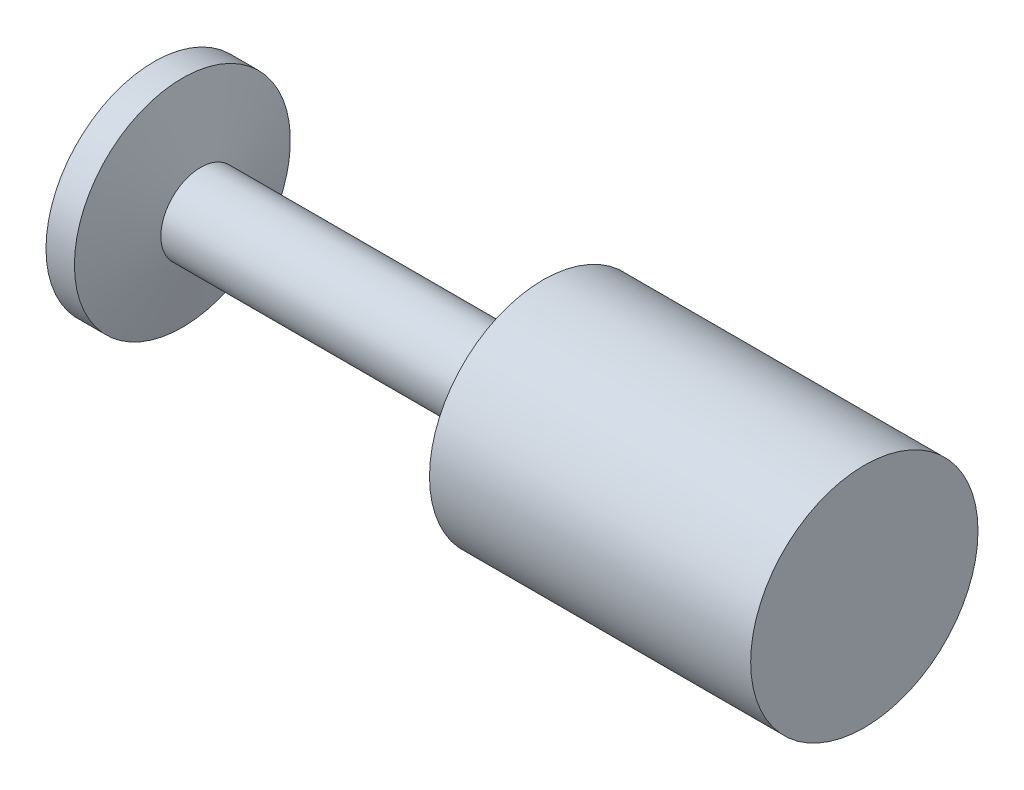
ISO-10303-21;
HEADER;
FILE_DESCRIPTION(('STEP AP214'),'2;1');
FILE_NAME('part.step','',(''),(''),'','','');
FILE_SCHEMA(('AUTOMOTIVE_DESIGN { 1 0 10303 214 1 1 1 1 }'));
ENDSEC;
DATA;
#1=APPLICATION_CONTEXT('core data for automotive mechanical design processes');
#2=APPLICATION_PROTOCOL_DEFINITION('international standard','automotive_design',2000,#1);
#3=PRODUCT_CONTEXT('',#1,'mechanical');
#4=PRODUCT('Part','Part','',(#3));
#5=PRODUCT_RELATED_PRODUCT_CATEGORY('part','',(#4));
#6=PRODUCT_DEFINITION_FORMATION('','',#4);
#7=PRODUCT_DEFINITION_CONTEXT('part definition',#1,'design');
#8=PRODUCT_DEFINITION('design','',#6,#7);
#9=PRODUCT_DEFINITION_SHAPE('','',#8);
#10=(LENGTH_UNIT() NAMED_UNIT(*) SI_UNIT(.MILLI.,.METRE.));
#11=(NAMED_UNIT(*) PLANE_ANGLE_UNIT() SI_UNIT($,.RADIAN.));
#12=(NAMED_UNIT(*) SI_UNIT($,.STERADIAN.) SOLID_ANGLE_UNIT());
#13=UNCERTAINTY_MEASURE_WITH_UNIT(LENGTH_MEASURE(1.E-05),#10,'distance_accuracy_value','');
#14=(GEOMETRIC_REPRESENTATION_CONTEXT(3) GLOBAL_UNCERTAINTY_ASSIGNED_CONTEXT((#13)) GLOBAL_UNIT_ASSIGNED_CONTEXT((#10,
#11,#12)) REPRESENTATION_CONTEXT('',''));
#15=CARTESIAN_POINT('',(0.,0.,0.));
#16=DIRECTION('',(0.,0.,1.));
#17=DIRECTION('',(1.,0.,0.));
#18=AXIS2_PLACEMENT_3D('',#15,#16,#17);
#19=CARTESIAN_POINT('',(0.,0.,0.));
#20=DIRECTION('',(1.,0.,0.));
#21=DIRECTION('',(0.,0.,-1.));
#22=AXIS2_PLACEMENT_3D('',#19,#20,#21);
#23=PLANE('',#22);
#24=CARTESIAN_POINT('',(0.,0.,0.));
#25=DIRECTION('',(-1.,0.,0.));
#26=DIRECTION('',(0.,0.,1.));
#27=AXIS2_PLACEMENT_3D('',#24,#25,#26);
#28=CIRCLE('',#27,19.);
#29=CARTESIAN_POINT('',(0.,0.,19.));
#30=VERTEX_POINT('',#29);
#31=EDGE_CURVE('E10',#30,#30,#28,.T.);
#32=ORIENTED_EDGE('',*,*,#31,.T.);
#33=EDGE_LOOP('',(#32));
#34=FACE_BOUND('',#33,.T.);
#35=ADVANCED_FACE('F30',(#34),#23,.F.);
#36=CARTESIAN_POINT('',(-18.0553016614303,0.,0.));
#37=DIRECTION('',(-1.,0.,0.));
#38=DIRECTION('',(0.,0.,1.));
#39=AXIS2_PLACEMENT_3D('',#36,#37,#38);
#40=CYLINDRICAL_SURFACE('',#39,19.);
#41=ORIENTED_EDGE('',*,*,#31,.F.);
#42=EDGE_LOOP('',(#41));
#43=FACE_BOUND('',#42,.T.);
#44=CARTESIAN_POINT('',(5.,0.,0.));
#45=DIRECTION('',(-1.,0.,0.));
#46=DIRECTION('',(0.,0.,1.));
#47=AXIS2_PLACEMENT_3D('',#44,#45,#46);
#48=CIRCLE('',#47,19.);
#49=CARTESIAN_POINT('',(5.,0.,19.));
#50=VERTEX_POINT('',#49);
#51=EDGE_CURVE('E36',#50,#50,#48,.T.);
#52=ORIENTED_EDGE('',*,*,#51,.T.);
#53=EDGE_LOOP('',(#52));
#54=FACE_BOUND('',#53,.T.);
#55=ADVANCED_FACE('F68',(#43,#54),#40,.T.);
#56=CARTESIAN_POINT('',(8.21539030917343,0.,0.));
#57=DIRECTION('',(-1.,0.,0.));
#58=DIRECTION('',(0.,0.,1.));
#59=AXIS2_PLACEMENT_3D('',#56,#57,#58);
#60=CONICAL_SURFACE('',#59,7.,1.30899693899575);
#61=ORIENTED_EDGE('',*,*,#51,.F.);
#62=EDGE_LOOP('',(#61));
#63=FACE_BOUND('',#62,.T.);
#64=CARTESIAN_POINT('',(8.21539030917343,0.,0.));
#65=DIRECTION('',(-1.,0.,0.));
#66=DIRECTION('',(0.,0.,1.));
#67=AXIS2_PLACEMENT_3D('',#64,#65,#66);
#68=CIRCLE('',#67,7.);
#69=CARTESIAN_POINT('',(8.21539030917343,0.,7.));
#70=VERTEX_POINT('',#69);
#71=EDGE_CURVE('E40',#70,#70,#68,.T.);
#72=ORIENTED_EDGE('',*,*,#71,.T.);
#73=EDGE_LOOP('',(#72));
#74=FACE_BOUND('',#73,.T.);
#75=ADVANCED_FACE('F72',(#63,#74),#60,.T.);
#76=CARTESIAN_POINT('',(-18.0553016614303,0.,0.));
#77=DIRECTION('',(-1.,0.,0.));
#78=DIRECTION('',(0.,0.,1.));
#79=AXIS2_PLACEMENT_3D('',#76,#77,#78);
#80=CYLINDRICAL_SURFACE('',#79,7.);
#81=ORIENTED_EDGE('',*,*,#71,.F.);
#82=EDGE_LOOP('',(#81));
#83=FACE_BOUND('',#82,.T.);
#84=CARTESIAN_POINT('',(65.,0.,0.));
#85=DIRECTION('',(-1.,0.,0.));
#86=DIRECTION('',(0.,0.,1.));
#87=AXIS2_PLACEMENT_3D('',#84,#85,#86);
#88=CIRCLE('',#87,7.);
#89=CARTESIAN_POINT('',(65.,0.,7.));
#90=VERTEX_POINT('',#89);
#91=EDGE_CURVE('E44',#90,#90,#88,.T.);
#92=ORIENTED_EDGE('',*,*,#91,.T.);
#93=EDGE_LOOP('',(#92));
#94=FACE_BOUND('',#93,.T.);
#95=ADVANCED_FACE('F77',(#83,#94),#80,.T.);
#96=CARTESIAN_POINT('',(68.4833395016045,0.,0.));
#97=DIRECTION('',(1.,0.,0.));
#98=DIRECTION('',(0.,0.,-1.));
#99=AXIS2_PLACEMENT_3D('',#96,#97,#98);
#100=CONICAL_SURFACE('',#99,20.,1.30899693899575);
#101=ORIENTED_EDGE('',*,*,#91,.F.);
#102=EDGE_LOOP('',(#101));
#103=FACE_BOUND('',#102,.T.);
#104=CARTESIAN_POINT('',(68.4833395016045,0.,0.));
#105=DIRECTION('',(-1.,0.,0.));
#106=DIRECTION('',(0.,0.,1.));
#107=AXIS2_PLACEMENT_3D('',#104,#105,#106);
#108=CIRCLE('',#107,20.);
#109=CARTESIAN_POINT('',(68.4833395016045,0.,20.));
#110=VERTEX_POINT('',#109);
#111=EDGE_CURVE('E49',#110,#110,#108,.T.);
#112=ORIENTED_EDGE('',*,*,#111,.T.);
#113=EDGE_LOOP('',(#112));
#114=FACE_BOUND('',#113,.T.);
#115=ADVANCED_FACE('F64',(#103,#114),#100,.T.);
#116=CARTESIAN_POINT('',(-18.0553016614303,0.,0.));
#117=DIRECTION('',(-1.,0.,0.));
#118=DIRECTION('',(0.,0.,1.));
#119=AXIS2_PLACEMENT_3D('',#116,#117,#118);
#120=CYLINDRICAL_SURFACE('',#119,20.);
#121=ORIENTED_EDGE('',*,*,#111,.F.);
#122=EDGE_LOOP('',(#121));
#123=FACE_BOUND('',#122,.T.);
#124=CARTESIAN_POINT('',(125.,0.,0.));
#125=DIRECTION('',(-1.,0.,0.));
#126=DIRECTION('',(0.,0.,1.));
#127=AXIS2_PLACEMENT_3D('',#124,#125,#126);
#128=CIRCLE('',#127,20.);
#129=CARTESIAN_POINT('',(125.,0.,20.));
#130=VERTEX_POINT('',#129);
#131=EDGE_CURVE('E52',#130,#130,#128,.T.);
#132=ORIENTED_EDGE('',*,*,#131,.T.);
#133=EDGE_LOOP('',(#132));
#134=FACE_BOUND('',#133,.T.);
#135=ADVANCED_FACE('F56',(#123,#134),#120,.T.);
#136=CARTESIAN_POINT('',(125.,20.,0.));
#137=DIRECTION('',(-1.,0.,0.));
#138=DIRECTION('',(0.,0.,1.));
#139=AXIS2_PLACEMENT_3D('',#136,#137,#138);
#140=PLANE('',#139);
#141=ORIENTED_EDGE('',*,*,#131,.F.);
#142=EDGE_LOOP('',(#141));
#143=FACE_BOUND('',#142,.T.);
#144=ADVANCED_FACE('F58',(#143),#140,.F.);
#145=CLOSED_SHELL('',(#35,#55,#75,#95,#115,#135,#144));
#146=MANIFOLD_SOLID_BREP('B2',#145);
#147=ADVANCED_BREP_SHAPE_REPRESENTATION('',(#18,#146),#14);
#148=SHAPE_DEFINITION_REPRESENTATION(#9,#147);
ENDSEC;
END-ISO-10303-21;
